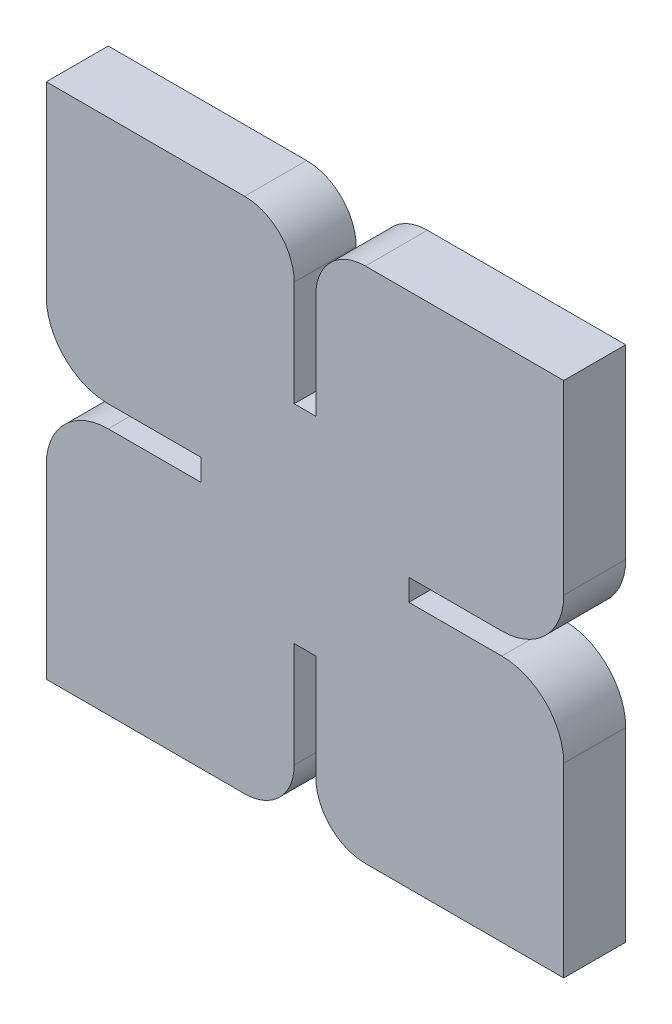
from build123d import *

# Parameters (mm, degrees)
BOSS_EXTRUDE1_DEPTH = 10


with BuildPart() as part:
    # Sketch1 → Boss-Extrude1 (new body)
    with BuildSketch(Plane.XY):
        with BuildLine():
            Line((1.75, 16.75), (1.75, 33.75))
            ThreePointArc((1.75, 33.75), (4.093145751, 39.406854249), (9.75, 41.75))
            Line((9.75, 41.75), (41.75, 41.75))
            Line((41.75, 41.75), (41.75, 11.75))
            ThreePointArc((41.75, 11.75), (38.821067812, 4.678932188), (31.75, 1.75))
            Line((31.75, 1.75), (16.75, 1.75))
            Line((16.75, 1.75), (16.75, -1.75))
            Line((16.75, -1.75), (31.75, -1.75))
            ThreePointArc((31.75, -1.75), (38.821067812, -4.678932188), (41.75, -11.75))
            Line((41.75, -11.75), (41.75, -41.75))
            Line((41.75, -41.75), (9.75, -41.75))
            ThreePointArc((9.75, -41.75), (4.093145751, -39.406854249), (1.75, -33.75))
            Line((1.75, -33.75), (1.75, -16.75))
            Line((1.75, -16.75), (-1.75, -16.75))
            Line((-1.75, -16.75), (-1.75, -33.75))
            ThreePointArc((-1.75, -33.75), (-4.093145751, -39.406854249), (-9.75, -41.75))
            Line((-9.75, -41.75), (-41.75, -41.75))
            Line((-41.75, -41.75), (-41.75, -11.75))
            ThreePointArc((-41.75, -11.75), (-38.821067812, -4.678932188), (-31.75, -1.75))
            Line((-31.75, -1.75), (-16.75, -1.75))
            Line((-16.75, -1.75), (-16.75, 1.75))
            Line((-16.75, 1.75), (-31.75, 1.75))
            ThreePointArc((-31.75, 1.75), (-38.821067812, 4.678932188), (-41.75, 11.75))
            Line((-41.75, 11.75), (-41.75, 41.75))
            Line((-41.75, 41.75), (-9.75, 41.75))
            ThreePointArc((-9.75, 41.75), (-4.093145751, 39.406854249), (-1.75, 33.75))
            Line((-1.75, 33.75), (-1.75, 16.75))
            Line((-1.75, 16.75), (1.75, 16.75))
        make_face()
    extrude(amount=BOSS_EXTRUDE1_DEPTH)


solid = part.part
